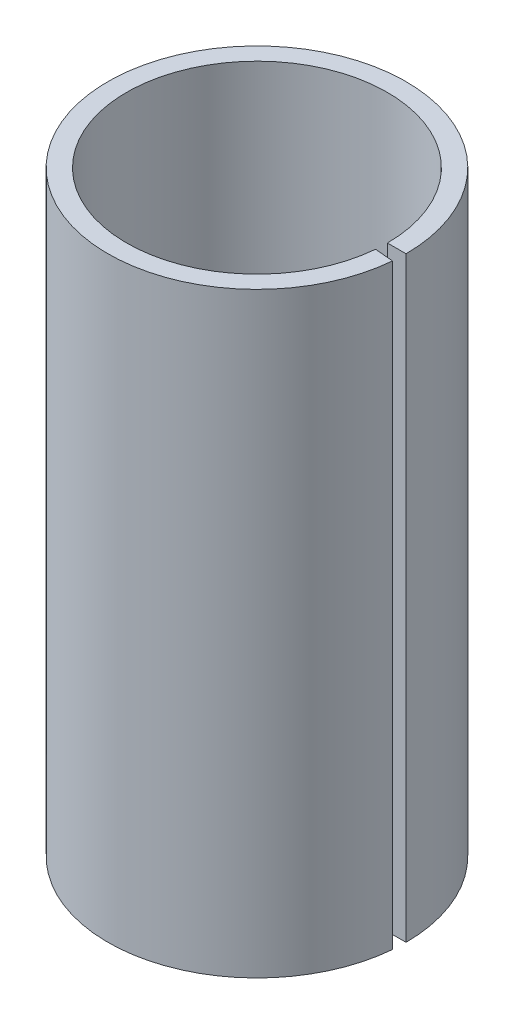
from build123d import *

# Parameters (mm, degrees)
SKETCH1_W      = 0.5
SKETCH1_H      = 16
REVOLVE1_ANGLE = 355


with BuildPart() as part:
    # Sketch1 → Revolve1 (revolve)
    with BuildSketch(Plane.XY):
        with Locations((3.75, 7.880247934)):
            Rectangle(SKETCH1_W, SKETCH1_H)
    revolve(axis=Axis((0, -10.884214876, 0), (0, 1, 0)), revolution_arc=REVOLVE1_ANGLE)


solid = part.part
